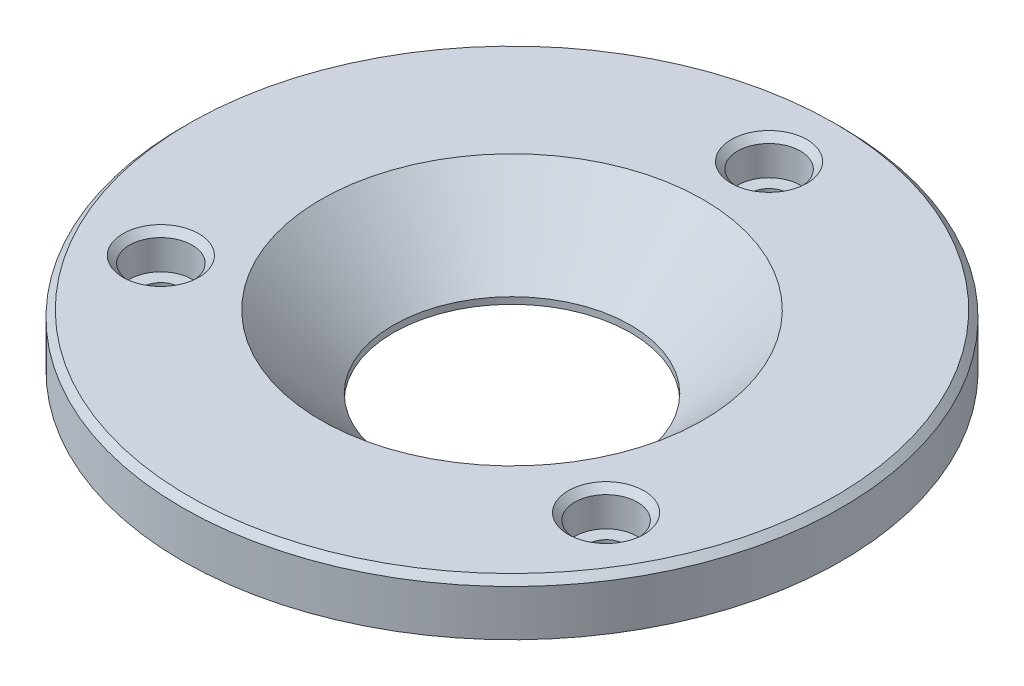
ISO-10303-21;
HEADER;
FILE_DESCRIPTION(('STEP AP214'),'2;1');
FILE_NAME('part.step','',(''),(''),'','','');
FILE_SCHEMA(('AUTOMOTIVE_DESIGN { 1 0 10303 214 1 1 1 1 }'));
ENDSEC;
DATA;
#1=APPLICATION_CONTEXT('core data for automotive mechanical design processes');
#2=APPLICATION_PROTOCOL_DEFINITION('international standard','automotive_design',2000,#1);
#3=PRODUCT_CONTEXT('',#1,'mechanical');
#4=PRODUCT('Part','Part','',(#3));
#5=PRODUCT_RELATED_PRODUCT_CATEGORY('part','',(#4));
#6=PRODUCT_DEFINITION_FORMATION('','',#4);
#7=PRODUCT_DEFINITION_CONTEXT('part definition',#1,'design');
#8=PRODUCT_DEFINITION('design','',#6,#7);
#9=PRODUCT_DEFINITION_SHAPE('','',#8);
#10=(LENGTH_UNIT() NAMED_UNIT(*) SI_UNIT(.MILLI.,.METRE.));
#11=(NAMED_UNIT(*) PLANE_ANGLE_UNIT() SI_UNIT($,.RADIAN.));
#12=(NAMED_UNIT(*) SI_UNIT($,.STERADIAN.) SOLID_ANGLE_UNIT());
#13=UNCERTAINTY_MEASURE_WITH_UNIT(LENGTH_MEASURE(1.E-05),#10,'distance_accuracy_value','');
#14=(GEOMETRIC_REPRESENTATION_CONTEXT(3) GLOBAL_UNCERTAINTY_ASSIGNED_CONTEXT((#13)) GLOBAL_UNIT_ASSIGNED_CONTEXT((#10,
#11,#12)) REPRESENTATION_CONTEXT('',''));
#15=CARTESIAN_POINT('',(0.,0.,0.));
#16=DIRECTION('',(0.,0.,1.));
#17=DIRECTION('',(1.,0.,0.));
#18=AXIS2_PLACEMENT_3D('',#15,#16,#17);
#19=CARTESIAN_POINT('',(-29.,12.,0.));
#20=DIRECTION('',(0.,-1.,0.));
#21=DIRECTION('',(0.,0.,-1.));
#22=AXIS2_PLACEMENT_3D('',#19,#20,#21);
#23=PLANE('',#22);
#24=CARTESIAN_POINT('',(33.7749907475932,12.,19.5));
#25=DIRECTION('',(0.,-1.,0.));
#26=DIRECTION('',(0.,0.,-1.));
#27=AXIS2_PLACEMENT_3D('',#24,#25,#26);
#28=CIRCLE('',#27,5.75);
#29=CARTESIAN_POINT('',(33.7749907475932,12.,13.75));
#30=VERTEX_POINT('',#29);
#31=EDGE_CURVE('E25',#30,#30,#28,.T.);
#32=ORIENTED_EDGE('',*,*,#31,.T.);
#33=EDGE_LOOP('',(#32));
#34=FACE_BOUND('',#33,.T.);
#35=CARTESIAN_POINT('',(0.,12.,-39.));
#36=DIRECTION('',(0.,-1.,0.));
#37=DIRECTION('',(0.,0.,-1.));
#38=AXIS2_PLACEMENT_3D('',#35,#36,#37);
#39=CIRCLE('',#38,5.75);
#40=CARTESIAN_POINT('',(0.,12.,-44.75));
#41=VERTEX_POINT('',#40);
#42=EDGE_CURVE('E29',#41,#41,#39,.T.);
#43=ORIENTED_EDGE('',*,*,#42,.T.);
#44=EDGE_LOOP('',(#43));
#45=FACE_BOUND('',#44,.T.);
#46=CARTESIAN_POINT('',(-33.7749907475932,12.,19.5));
#47=DIRECTION('',(0.,-1.,0.));
#48=DIRECTION('',(0.,0.,-1.));
#49=AXIS2_PLACEMENT_3D('',#46,#47,#48);
#50=CIRCLE('',#49,5.75);
#51=CARTESIAN_POINT('',(-33.7749907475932,12.,13.75));
#52=VERTEX_POINT('',#51);
#53=EDGE_CURVE('E34',#52,#52,#50,.T.);
#54=ORIENTED_EDGE('',*,*,#53,.T.);
#55=EDGE_LOOP('',(#54));
#56=FACE_BOUND('',#55,.T.);
#57=CARTESIAN_POINT('',(0.,12.,0.));
#58=DIRECTION('',(0.,-1.,0.));
#59=DIRECTION('',(0.,0.,-1.));
#60=AXIS2_PLACEMENT_3D('',#57,#58,#59);
#61=CIRCLE('',#60,49.);
#62=CARTESIAN_POINT('',(0.,12.,-49.));
#63=VERTEX_POINT('',#62);
#64=EDGE_CURVE('E58',#63,#63,#61,.F.);
#65=ORIENTED_EDGE('',*,*,#64,.T.);
#66=EDGE_LOOP('',(#65));
#67=FACE_BOUND('',#66,.T.);
#68=CARTESIAN_POINT('',(0.,12.,0.));
#69=DIRECTION('',(0.,-1.,0.));
#70=DIRECTION('',(0.,0.,-1.));
#71=AXIS2_PLACEMENT_3D('',#68,#69,#70);
#72=CIRCLE('',#71,29.);
#73=CARTESIAN_POINT('',(0.,12.,-29.));
#74=VERTEX_POINT('',#73);
#75=EDGE_CURVE('E70',#74,#74,#72,.T.);
#76=ORIENTED_EDGE('',*,*,#75,.T.);
#77=EDGE_LOOP('',(#76));
#78=FACE_BOUND('',#77,.T.);
#79=ADVANCED_FACE('F14',(#34,#45,#56,#67,#78),#23,.F.);
#80=CARTESIAN_POINT('',(0.,1.,0.));
#81=DIRECTION('',(0.,1.,0.));
#82=DIRECTION('',(0.,0.,1.));
#83=AXIS2_PLACEMENT_3D('',#80,#81,#82);
#84=CONICAL_SURFACE('',#83,18.,0.78539816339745);
#85=ORIENTED_EDGE('',*,*,#75,.F.);
#86=EDGE_LOOP('',(#85));
#87=FACE_BOUND('',#86,.T.);
#88=CARTESIAN_POINT('',(0.,1.,0.));
#89=DIRECTION('',(0.,-1.,0.));
#90=DIRECTION('',(0.,0.,-1.));
#91=AXIS2_PLACEMENT_3D('',#88,#89,#90);
#92=CIRCLE('',#91,18.);
#93=CARTESIAN_POINT('',(0.,1.,-18.));
#94=VERTEX_POINT('',#93);
#95=EDGE_CURVE('E83',#94,#94,#92,.T.);
#96=ORIENTED_EDGE('',*,*,#95,.T.);
#97=EDGE_LOOP('',(#96));
#98=FACE_BOUND('',#97,.T.);
#99=ADVANCED_FACE('F123',(#87,#98),#84,.F.);
#100=CARTESIAN_POINT('',(0.,0.,0.));
#101=DIRECTION('',(0.,-1.,0.));
#102=DIRECTION('',(0.,0.,-1.));
#103=AXIS2_PLACEMENT_3D('',#100,#101,#102);
#104=CYLINDRICAL_SURFACE('',#103,18.);
#105=ORIENTED_EDGE('',*,*,#95,.F.);
#106=EDGE_LOOP('',(#105));
#107=FACE_BOUND('',#106,.T.);
#108=CARTESIAN_POINT('',(0.,0.,0.));
#109=DIRECTION('',(0.,-1.,0.));
#110=DIRECTION('',(0.,0.,-1.));
#111=AXIS2_PLACEMENT_3D('',#108,#109,#110);
#112=CIRCLE('',#111,18.);
#113=CARTESIAN_POINT('',(0.,0.,-18.));
#114=VERTEX_POINT('',#113);
#115=EDGE_CURVE('E86',#114,#114,#112,.T.);
#116=ORIENTED_EDGE('',*,*,#115,.T.);
#117=EDGE_LOOP('',(#116));
#118=FACE_BOUND('',#117,.T.);
#119=ADVANCED_FACE('F130',(#107,#118),#104,.F.);
#120=CARTESIAN_POINT('',(-18.,0.,0.));
#121=DIRECTION('',(0.,1.,0.));
#122=DIRECTION('',(0.,0.,1.));
#123=AXIS2_PLACEMENT_3D('',#120,#121,#122);
#124=PLANE('',#123);
#125=CARTESIAN_POINT('',(-33.7749907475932,0.,19.5));
#126=DIRECTION('',(0.,1.,0.));
#127=DIRECTION('',(0.,0.,1.));
#128=AXIS2_PLACEMENT_3D('',#125,#126,#127);
#129=CIRCLE('',#128,3.75);
#130=CARTESIAN_POINT('',(-33.7749907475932,0.,23.25));
#131=VERTEX_POINT('',#130);
#132=EDGE_CURVE('E49',#131,#131,#129,.T.);
#133=ORIENTED_EDGE('',*,*,#132,.T.);
#134=EDGE_LOOP('',(#133));
#135=FACE_BOUND('',#134,.T.);
#136=CARTESIAN_POINT('',(33.7749907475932,0.,19.5));
#137=DIRECTION('',(0.,1.,0.));
#138=DIRECTION('',(0.,0.,1.));
#139=AXIS2_PLACEMENT_3D('',#136,#137,#138);
#140=CIRCLE('',#139,3.75);
#141=CARTESIAN_POINT('',(33.7749907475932,0.,23.25));
#142=VERTEX_POINT('',#141);
#143=EDGE_CURVE('E52',#142,#142,#140,.T.);
#144=ORIENTED_EDGE('',*,*,#143,.T.);
#145=EDGE_LOOP('',(#144));
#146=FACE_BOUND('',#145,.T.);
#147=CARTESIAN_POINT('',(0.,0.,-39.));
#148=DIRECTION('',(0.,1.,0.));
#149=DIRECTION('',(0.,0.,1.));
#150=AXIS2_PLACEMENT_3D('',#147,#148,#149);
#151=CIRCLE('',#150,3.75);
#152=CARTESIAN_POINT('',(0.,0.,-35.25));
#153=VERTEX_POINT('',#152);
#154=EDGE_CURVE('E55',#153,#153,#151,.T.);
#155=ORIENTED_EDGE('',*,*,#154,.T.);
#156=EDGE_LOOP('',(#155));
#157=FACE_BOUND('',#156,.T.);
#158=CARTESIAN_POINT('',(0.,0.,0.));
#159=DIRECTION('',(0.,1.,0.));
#160=DIRECTION('',(0.,0.,1.));
#161=AXIS2_PLACEMENT_3D('',#158,#159,#160);
#162=CIRCLE('',#161,44.);
#163=CARTESIAN_POINT('',(0.,0.,44.));
#164=VERTEX_POINT('',#163);
#165=EDGE_CURVE('E67',#164,#164,#162,.F.);
#166=ORIENTED_EDGE('',*,*,#165,.T.);
#167=EDGE_LOOP('',(#166));
#168=FACE_BOUND('',#167,.T.);
#169=ORIENTED_EDGE('',*,*,#115,.F.);
#170=EDGE_LOOP('',(#169));
#171=FACE_BOUND('',#170,.T.);
#172=ADVANCED_FACE('F181',(#135,#146,#157,#168,#171),#124,.F.);
#173=CARTESIAN_POINT('',(0.,0.,0.));
#174=DIRECTION('',(0.,-1.,0.));
#175=DIRECTION('',(0.,0.,-1.));
#176=AXIS2_PLACEMENT_3D('',#173,#174,#175);
#177=CYLINDRICAL_SURFACE('',#176,45.);
#178=CARTESIAN_POINT('',(0.,1.00000000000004,0.));
#179=DIRECTION('',(0.,1.,0.));
#180=DIRECTION('',(0.,0.,1.));
#181=AXIS2_PLACEMENT_3D('',#178,#179,#180);
#182=CIRCLE('',#181,45.);
#183=CARTESIAN_POINT('',(0.,1.00000000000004,45.));
#184=VERTEX_POINT('',#183);
#185=EDGE_CURVE('E64',#184,#184,#182,.T.);
#186=ORIENTED_EDGE('',*,*,#185,.T.);
#187=EDGE_LOOP('',(#186));
#188=FACE_BOUND('',#187,.T.);
#189=CARTESIAN_POINT('',(0.,4.,0.));
#190=DIRECTION('',(0.,-1.,0.));
#191=DIRECTION('',(0.,0.,-1.));
#192=AXIS2_PLACEMENT_3D('',#189,#190,#191);
#193=CIRCLE('',#192,45.);
#194=CARTESIAN_POINT('',(0.,4.,-45.));
#195=VERTEX_POINT('',#194);
#196=EDGE_CURVE('E89',#195,#195,#193,.T.);
#197=ORIENTED_EDGE('',*,*,#196,.T.);
#198=EDGE_LOOP('',(#197));
#199=FACE_BOUND('',#198,.T.);
#200=ADVANCED_FACE('F185',(#188,#199),#177,.T.);
#201=CARTESIAN_POINT('',(-45.,4.,0.));
#202=DIRECTION('',(0.,1.,0.));
#203=DIRECTION('',(0.,0.,1.));
#204=AXIS2_PLACEMENT_3D('',#201,#202,#203);
#205=PLANE('',#204);
#206=ORIENTED_EDGE('',*,*,#196,.F.);
#207=EDGE_LOOP('',(#206));
#208=FACE_BOUND('',#207,.T.);
#209=CARTESIAN_POINT('',(0.,4.,0.));
#210=DIRECTION('',(0.,-1.,0.));
#211=DIRECTION('',(0.,0.,-1.));
#212=AXIS2_PLACEMENT_3D('',#209,#210,#211);
#213=CIRCLE('',#212,50.);
#214=CARTESIAN_POINT('',(0.,4.,-50.));
#215=VERTEX_POINT('',#214);
#216=EDGE_CURVE('E92',#215,#215,#213,.T.);
#217=ORIENTED_EDGE('',*,*,#216,.T.);
#218=EDGE_LOOP('',(#217));
#219=FACE_BOUND('',#218,.T.);
#220=ADVANCED_FACE('F192',(#208,#219),#205,.F.);
#221=CARTESIAN_POINT('',(0.,0.,0.));
#222=DIRECTION('',(0.,-1.,0.));
#223=DIRECTION('',(0.,0.,-1.));
#224=AXIS2_PLACEMENT_3D('',#221,#222,#223);
#225=CYLINDRICAL_SURFACE('',#224,50.);
#226=CARTESIAN_POINT('',(0.,11.,0.));
#227=DIRECTION('',(0.,-1.,0.));
#228=DIRECTION('',(0.,0.,-1.));
#229=AXIS2_PLACEMENT_3D('',#226,#227,#228);
#230=CIRCLE('',#229,50.);
#231=CARTESIAN_POINT('',(0.,11.,-50.));
#232=VERTEX_POINT('',#231);
#233=EDGE_CURVE('E61',#232,#232,#230,.T.);
#234=ORIENTED_EDGE('',*,*,#233,.T.);
#235=EDGE_LOOP('',(#234));
#236=FACE_BOUND('',#235,.T.);
#237=ORIENTED_EDGE('',*,*,#216,.F.);
#238=EDGE_LOOP('',(#237));
#239=FACE_BOUND('',#238,.T.);
#240=ADVANCED_FACE('F199',(#236,#239),#225,.T.);
#241=CARTESIAN_POINT('',(33.7749907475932,6.5,19.5));
#242=DIRECTION('',(0.,1.,0.));
#243=DIRECTION('',(0.,0.,1.));
#244=AXIS2_PLACEMENT_3D('',#241,#242,#243);
#245=CYLINDRICAL_SURFACE('',#244,4.75);
#246=CARTESIAN_POINT('',(33.7749907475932,11.,19.5));
#247=DIRECTION('',(0.,-1.,0.));
#248=DIRECTION('',(0.,0.,-1.));
#249=AXIS2_PLACEMENT_3D('',#246,#247,#248);
#250=CIRCLE('',#249,4.75);
#251=CARTESIAN_POINT('',(33.7749907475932,11.,14.75));
#252=VERTEX_POINT('',#251);
#253=EDGE_CURVE('E37',#252,#252,#250,.F.);
#254=ORIENTED_EDGE('',*,*,#253,.T.);
#255=EDGE_LOOP('',(#254));
#256=FACE_BOUND('',#255,.T.);
#257=CARTESIAN_POINT('',(33.7749907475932,6.5,19.5));
#258=DIRECTION('',(0.,1.,0.));
#259=DIRECTION('',(0.,0.,-1.));
#260=AXIS2_PLACEMENT_3D('',#257,#258,#259);
#261=CIRCLE('',#260,4.75);
#262=CARTESIAN_POINT('',(33.7749907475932,6.5,14.75));
#263=VERTEX_POINT('',#262);
#264=EDGE_CURVE('E74',#263,#263,#261,.T.);
#265=ORIENTED_EDGE('',*,*,#264,.F.);
#266=EDGE_LOOP('',(#265));
#267=FACE_BOUND('',#266,.T.);
#268=ADVANCED_FACE('F203',(#256,#267),#245,.F.);
#269=CARTESIAN_POINT('',(33.7749907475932,6.5,19.5));
#270=DIRECTION('',(0.,-1.,0.));
#271=DIRECTION('',(0.,0.,-1.));
#272=AXIS2_PLACEMENT_3D('',#269,#270,#271);
#273=PLANE('',#272);
#274=CARTESIAN_POINT('',(33.7749907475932,6.5,19.5));
#275=DIRECTION('',(0.,-1.,0.));
#276=DIRECTION('',(0.,0.,-1.));
#277=AXIS2_PLACEMENT_3D('',#274,#275,#276);
#278=CIRCLE('',#277,2.75);
#279=CARTESIAN_POINT('',(33.7749907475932,6.5,16.75));
#280=VERTEX_POINT('',#279);
#281=EDGE_CURVE('E71',#280,#280,#278,.T.);
#282=ORIENTED_EDGE('',*,*,#281,.T.);
#283=EDGE_LOOP('',(#282));
#284=FACE_BOUND('',#283,.T.);
#285=ORIENTED_EDGE('',*,*,#264,.T.);
#286=EDGE_LOOP('',(#285));
#287=FACE_BOUND('',#286,.T.);
#288=ADVANCED_FACE('F207',(#284,#287),#273,.F.);
#289=CARTESIAN_POINT('',(-33.7749907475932,6.5,19.5));
#290=DIRECTION('',(0.,1.,0.));
#291=DIRECTION('',(0.,0.,1.));
#292=AXIS2_PLACEMENT_3D('',#289,#290,#291);
#293=CYLINDRICAL_SURFACE('',#292,4.75);
#294=CARTESIAN_POINT('',(-33.7749907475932,11.,19.5));
#295=DIRECTION('',(0.,-1.,0.));
#296=DIRECTION('',(0.,0.,-1.));
#297=AXIS2_PLACEMENT_3D('',#294,#295,#296);
#298=CIRCLE('',#297,4.75);
#299=CARTESIAN_POINT('',(-33.7749907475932,11.,14.75));
#300=VERTEX_POINT('',#299);
#301=EDGE_CURVE('E9',#300,#300,#298,.F.);
#302=ORIENTED_EDGE('',*,*,#301,.T.);
#303=EDGE_LOOP('',(#302));
#304=FACE_BOUND('',#303,.T.);
#305=CARTESIAN_POINT('',(-33.7749907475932,6.5,19.5));
#306=DIRECTION('',(0.,1.,0.));
#307=DIRECTION('',(0.,0.,1.));
#308=AXIS2_PLACEMENT_3D('',#305,#306,#307);
#309=CIRCLE('',#308,4.75);
#310=CARTESIAN_POINT('',(-33.7749907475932,6.5,24.25));
#311=VERTEX_POINT('',#310);
#312=EDGE_CURVE('E98',#311,#311,#309,.T.);
#313=ORIENTED_EDGE('',*,*,#312,.F.);
#314=EDGE_LOOP('',(#313));
#315=FACE_BOUND('',#314,.T.);
#316=ADVANCED_FACE('F119',(#304,#315),#293,.F.);
#317=CARTESIAN_POINT('',(-33.7749907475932,6.5,19.5));
#318=DIRECTION('',(0.,1.,0.));
#319=DIRECTION('',(0.,0.,1.));
#320=AXIS2_PLACEMENT_3D('',#317,#318,#319);
#321=PLANE('',#320);
#322=CARTESIAN_POINT('',(-33.7749907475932,6.5,19.5));
#323=DIRECTION('',(0.,1.,0.));
#324=DIRECTION('',(0.,0.,1.));
#325=AXIS2_PLACEMENT_3D('',#322,#323,#324);
#326=CIRCLE('',#325,2.75);
#327=CARTESIAN_POINT('',(-33.7749907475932,6.5,22.25));
#328=VERTEX_POINT('',#327);
#329=EDGE_CURVE('E75',#328,#328,#326,.T.);
#330=ORIENTED_EDGE('',*,*,#329,.F.);
#331=EDGE_LOOP('',(#330));
#332=FACE_BOUND('',#331,.T.);
#333=ORIENTED_EDGE('',*,*,#312,.T.);
#334=EDGE_LOOP('',(#333));
#335=FACE_BOUND('',#334,.T.);
#336=ADVANCED_FACE('F108',(#332,#335),#321,.T.);
#337=CARTESIAN_POINT('',(0.,6.5,-39.));
#338=DIRECTION('',(0.,1.,0.));
#339=DIRECTION('',(0.,0.,1.));
#340=AXIS2_PLACEMENT_3D('',#337,#338,#339);
#341=CYLINDRICAL_SURFACE('',#340,4.75);
#342=CARTESIAN_POINT('',(0.,11.,-39.));
#343=DIRECTION('',(0.,-1.,0.));
#344=DIRECTION('',(0.,0.,-1.));
#345=AXIS2_PLACEMENT_3D('',#342,#343,#344);
#346=CIRCLE('',#345,4.75);
#347=CARTESIAN_POINT('',(0.,11.,-43.75));
#348=VERTEX_POINT('',#347);
#349=EDGE_CURVE('E21',#348,#348,#346,.F.);
#350=ORIENTED_EDGE('',*,*,#349,.T.);
#351=EDGE_LOOP('',(#350));
#352=FACE_BOUND('',#351,.T.);
#353=CARTESIAN_POINT('',(0.,6.5,-39.));
#354=DIRECTION('',(0.,1.,0.));
#355=DIRECTION('',(0.,0.,1.));
#356=AXIS2_PLACEMENT_3D('',#353,#354,#355);
#357=CIRCLE('',#356,4.75);
#358=CARTESIAN_POINT('',(0.,6.5,-34.25));
#359=VERTEX_POINT('',#358);
#360=EDGE_CURVE('E95',#359,#359,#357,.T.);
#361=ORIENTED_EDGE('',*,*,#360,.F.);
#362=EDGE_LOOP('',(#361));
#363=FACE_BOUND('',#362,.T.);
#364=ADVANCED_FACE('F106',(#352,#363),#341,.F.);
#365=CARTESIAN_POINT('',(0.,6.5,-39.));
#366=DIRECTION('',(0.,1.,0.));
#367=DIRECTION('',(0.,0.,1.));
#368=AXIS2_PLACEMENT_3D('',#365,#366,#367);
#369=PLANE('',#368);
#370=CARTESIAN_POINT('',(0.,6.5,-39.));
#371=DIRECTION('',(0.,1.,0.));
#372=DIRECTION('',(0.,0.,1.));
#373=AXIS2_PLACEMENT_3D('',#370,#371,#372);
#374=CIRCLE('',#373,2.75);
#375=CARTESIAN_POINT('',(0.,6.5,-36.25));
#376=VERTEX_POINT('',#375);
#377=EDGE_CURVE('E78',#376,#376,#374,.T.);
#378=ORIENTED_EDGE('',*,*,#377,.F.);
#379=EDGE_LOOP('',(#378));
#380=FACE_BOUND('',#379,.T.);
#381=ORIENTED_EDGE('',*,*,#360,.T.);
#382=EDGE_LOOP('',(#381));
#383=FACE_BOUND('',#382,.T.);
#384=ADVANCED_FACE('F104',(#380,#383),#369,.T.);
#385=CARTESIAN_POINT('',(0.,0.,-39.));
#386=DIRECTION('',(0.,1.,0.));
#387=DIRECTION('',(0.,0.,1.));
#388=AXIS2_PLACEMENT_3D('',#385,#386,#387);
#389=CYLINDRICAL_SURFACE('',#388,2.75);
#390=CARTESIAN_POINT('',(0.,1.00000000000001,-39.));
#391=DIRECTION('',(0.,1.,0.));
#392=DIRECTION('',(0.,0.,1.));
#393=AXIS2_PLACEMENT_3D('',#390,#391,#392);
#394=CIRCLE('',#393,2.75);
#395=CARTESIAN_POINT('',(0.,1.00000000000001,-36.25));
#396=VERTEX_POINT('',#395);
#397=EDGE_CURVE('E40',#396,#396,#394,.F.);
#398=ORIENTED_EDGE('',*,*,#397,.T.);
#399=EDGE_LOOP('',(#398));
#400=FACE_BOUND('',#399,.T.);
#401=ORIENTED_EDGE('',*,*,#377,.T.);
#402=EDGE_LOOP('',(#401));
#403=FACE_BOUND('',#402,.T.);
#404=ADVANCED_FACE('F116',(#400,#403),#389,.F.);
#405=CARTESIAN_POINT('',(-33.7749907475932,0.,19.5));
#406=DIRECTION('',(0.,1.,0.));
#407=DIRECTION('',(0.,0.,1.));
#408=AXIS2_PLACEMENT_3D('',#405,#406,#407);
#409=CYLINDRICAL_SURFACE('',#408,2.75);
#410=CARTESIAN_POINT('',(-33.7749907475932,1.,19.5));
#411=DIRECTION('',(0.,1.,0.));
#412=DIRECTION('',(0.,0.,1.));
#413=AXIS2_PLACEMENT_3D('',#410,#411,#412);
#414=CIRCLE('',#413,2.75);
#415=CARTESIAN_POINT('',(-33.7749907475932,1.,22.25));
#416=VERTEX_POINT('',#415);
#417=EDGE_CURVE('E46',#416,#416,#414,.F.);
#418=ORIENTED_EDGE('',*,*,#417,.T.);
#419=EDGE_LOOP('',(#418));
#420=FACE_BOUND('',#419,.T.);
#421=ORIENTED_EDGE('',*,*,#329,.T.);
#422=EDGE_LOOP('',(#421));
#423=FACE_BOUND('',#422,.T.);
#424=ADVANCED_FACE('F338',(#420,#423),#409,.F.);
#425=CARTESIAN_POINT('',(33.7749907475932,0.,19.5));
#426=DIRECTION('',(0.,1.,0.));
#427=DIRECTION('',(0.,0.,1.));
#428=AXIS2_PLACEMENT_3D('',#425,#426,#427);
#429=CYLINDRICAL_SURFACE('',#428,2.75);
#430=CARTESIAN_POINT('',(33.7749907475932,1.,19.5));
#431=DIRECTION('',(0.,1.,0.));
#432=DIRECTION('',(0.,0.,1.));
#433=AXIS2_PLACEMENT_3D('',#430,#431,#432);
#434=CIRCLE('',#433,2.75);
#435=CARTESIAN_POINT('',(33.7749907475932,1.,22.25));
#436=VERTEX_POINT('',#435);
#437=EDGE_CURVE('E43',#436,#436,#434,.F.);
#438=ORIENTED_EDGE('',*,*,#437,.T.);
#439=EDGE_LOOP('',(#438));
#440=FACE_BOUND('',#439,.T.);
#441=ORIENTED_EDGE('',*,*,#281,.F.);
#442=EDGE_LOOP('',(#441));
#443=FACE_BOUND('',#442,.T.);
#444=ADVANCED_FACE('F140',(#440,#443),#429,.F.);
#445=CARTESIAN_POINT('',(0.,0.,0.));
#446=DIRECTION('',(0.,1.,0.));
#447=DIRECTION('',(0.,0.,1.));
#448=AXIS2_PLACEMENT_3D('',#445,#446,#447);
#449=CONICAL_SURFACE('',#448,44.,0.785398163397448);
#450=ORIENTED_EDGE('',*,*,#185,.F.);
#451=EDGE_LOOP('',(#450));
#452=FACE_BOUND('',#451,.T.);
#453=ORIENTED_EDGE('',*,*,#165,.F.);
#454=EDGE_LOOP('',(#453));
#455=FACE_BOUND('',#454,.T.);
#456=ADVANCED_FACE('F136',(#452,#455),#449,.T.);
#457=CARTESIAN_POINT('',(0.,11.,0.));
#458=DIRECTION('',(0.,-1.,0.));
#459=DIRECTION('',(0.,0.,-1.));
#460=AXIS2_PLACEMENT_3D('',#457,#458,#459);
#461=CONICAL_SURFACE('',#460,50.,0.785398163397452);
#462=ORIENTED_EDGE('',*,*,#64,.F.);
#463=EDGE_LOOP('',(#462));
#464=FACE_BOUND('',#463,.T.);
#465=ORIENTED_EDGE('',*,*,#233,.F.);
#466=EDGE_LOOP('',(#465));
#467=FACE_BOUND('',#466,.T.);
#468=ADVANCED_FACE('F139',(#464,#467),#461,.T.);
#469=CARTESIAN_POINT('',(-33.7749907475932,0.,19.5));
#470=DIRECTION('',(0.,-1.,0.));
#471=DIRECTION('',(0.,0.,-1.));
#472=AXIS2_PLACEMENT_3D('',#469,#470,#471);
#473=CONICAL_SURFACE('',#472,3.75,0.785398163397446);
#474=ORIENTED_EDGE('',*,*,#417,.F.);
#475=EDGE_LOOP('',(#474));
#476=FACE_BOUND('',#475,.T.);
#477=ORIENTED_EDGE('',*,*,#132,.F.);
#478=EDGE_LOOP('',(#477));
#479=FACE_BOUND('',#478,.T.);
#480=ADVANCED_FACE('F144',(#476,#479),#473,.F.);
#481=CARTESIAN_POINT('',(33.7749907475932,0.,19.5));
#482=DIRECTION('',(0.,-1.,0.));
#483=DIRECTION('',(0.,0.,-1.));
#484=AXIS2_PLACEMENT_3D('',#481,#482,#483);
#485=CONICAL_SURFACE('',#484,3.75,0.785398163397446);
#486=ORIENTED_EDGE('',*,*,#437,.F.);
#487=EDGE_LOOP('',(#486));
#488=FACE_BOUND('',#487,.T.);
#489=ORIENTED_EDGE('',*,*,#143,.F.);
#490=EDGE_LOOP('',(#489));
#491=FACE_BOUND('',#490,.T.);
#492=ADVANCED_FACE('F148',(#488,#491),#485,.F.);
#493=CARTESIAN_POINT('',(0.,0.,-39.));
#494=DIRECTION('',(0.,-1.,0.));
#495=DIRECTION('',(0.,0.,-1.));
#496=AXIS2_PLACEMENT_3D('',#493,#494,#495);
#497=CONICAL_SURFACE('',#496,3.75,0.785398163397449);
#498=ORIENTED_EDGE('',*,*,#397,.F.);
#499=EDGE_LOOP('',(#498));
#500=FACE_BOUND('',#499,.T.);
#501=ORIENTED_EDGE('',*,*,#154,.F.);
#502=EDGE_LOOP('',(#501));
#503=FACE_BOUND('',#502,.T.);
#504=ADVANCED_FACE('F152',(#500,#503),#497,.F.);
#505=CARTESIAN_POINT('',(33.7749907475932,11.,19.5));
#506=DIRECTION('',(0.,1.,0.));
#507=DIRECTION('',(0.,0.,1.));
#508=AXIS2_PLACEMENT_3D('',#505,#506,#507);
#509=CONICAL_SURFACE('',#508,4.75,0.785398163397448);
#510=ORIENTED_EDGE('',*,*,#31,.F.);
#511=EDGE_LOOP('',(#510));
#512=FACE_BOUND('',#511,.T.);
#513=ORIENTED_EDGE('',*,*,#253,.F.);
#514=EDGE_LOOP('',(#513));
#515=FACE_BOUND('',#514,.T.);
#516=ADVANCED_FACE('F156',(#512,#515),#509,.F.);
#517=CARTESIAN_POINT('',(0.,11.,-39.));
#518=DIRECTION('',(0.,1.,0.));
#519=DIRECTION('',(0.,0.,1.));
#520=AXIS2_PLACEMENT_3D('',#517,#518,#519);
#521=CONICAL_SURFACE('',#520,4.75,0.785398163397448);
#522=ORIENTED_EDGE('',*,*,#42,.F.);
#523=EDGE_LOOP('',(#522));
#524=FACE_BOUND('',#523,.T.);
#525=ORIENTED_EDGE('',*,*,#349,.F.);
#526=EDGE_LOOP('',(#525));
#527=FACE_BOUND('',#526,.T.);
#528=ADVANCED_FACE('F159',(#524,#527),#521,.F.);
#529=CARTESIAN_POINT('',(-33.7749907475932,11.,19.5));
#530=DIRECTION('',(0.,1.,0.));
#531=DIRECTION('',(0.,0.,1.));
#532=AXIS2_PLACEMENT_3D('',#529,#530,#531);
#533=CONICAL_SURFACE('',#532,4.75,0.785398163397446);
#534=ORIENTED_EDGE('',*,*,#53,.F.);
#535=EDGE_LOOP('',(#534));
#536=FACE_BOUND('',#535,.T.);
#537=ORIENTED_EDGE('',*,*,#301,.F.);
#538=EDGE_LOOP('',(#537));
#539=FACE_BOUND('',#538,.T.);
#540=ADVANCED_FACE('F16',(#536,#539),#533,.F.);
#541=CLOSED_SHELL('',(#79,#99,#119,#172,#200,#220,#240,#268,#288,#316,#336,#364,#384,#404,#424,
#444,#456,#468,#480,#492,#504,#516,#528,#540));
#542=MANIFOLD_SOLID_BREP('B1',#541);
#543=ADVANCED_BREP_SHAPE_REPRESENTATION('',(#18,#542),#14);
#544=SHAPE_DEFINITION_REPRESENTATION(#9,#543);
ENDSEC;
END-ISO-10303-21;
